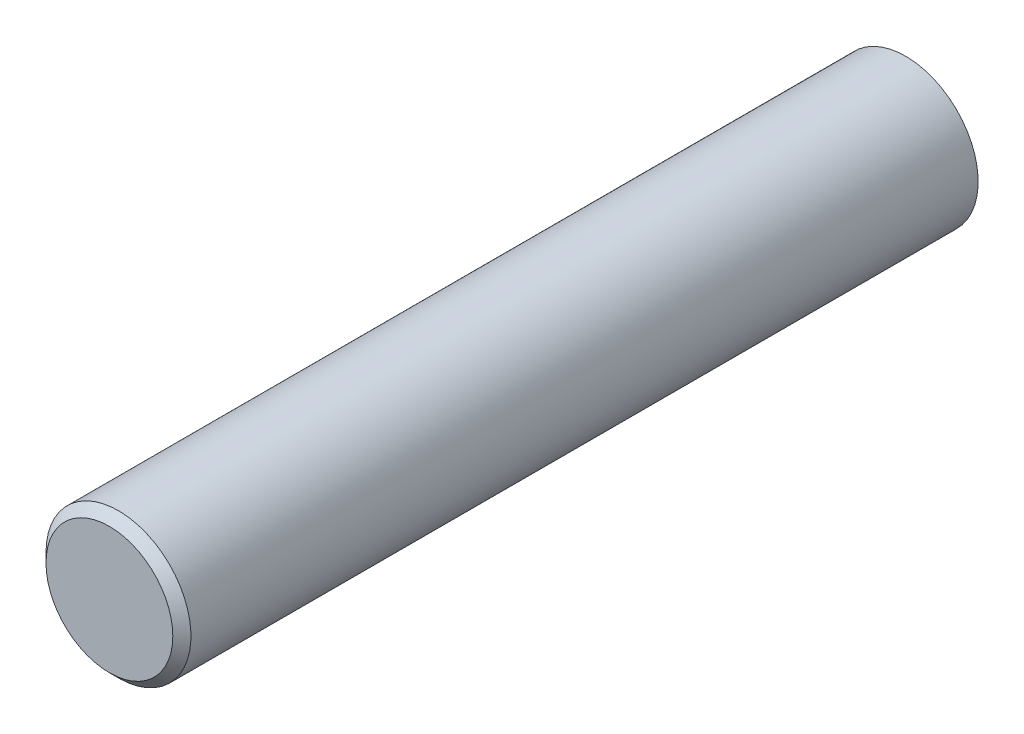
from build123d import *

# Parameters (mm, degrees)
ESQUISSE1_R        = 8
BOSS_EXTRU_1_DEPTH = 90
CHANFREIN1_SIZE    = 1


with BuildPart() as part:
    # Esquisse1 → Boss.-Extru.1 (new body)
    with BuildSketch(Plane.XY):
        with Locations(Location((0, 0, 0), (0, 0, 180))):
            Circle(ESQUISSE1_R)
    extrude(amount=BOSS_EXTRU_1_DEPTH)

    # Esquisse3 → Enl_vement de mati_re-R_volution1 (revolve, cut)
    with BuildSketch(Plane(origin=(0, 0, 0), x_dir=(0, 0, -1), z_dir=(1, 0, 0)), mode=Mode.PRIVATE) as enl_vement_de_mati_re_r_volution1_sk:
        with BuildLine():
            Line((0, 8), (-2.08633765, 8))
            ThreePointArc((-2.08633765, 8), (-0.530374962, 4.185425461), (0, 0.1))
            Line((0, 0.1), (0, 8))
        make_face()
    revolve(enl_vement_de_mati_re_r_volution1_sk.sketch.rotate(Axis((0, 0, 0), (0, 0, 1)), 90), axis=Axis((0, 0, 0), (0, 0, 1)), mode=Mode.SUBTRACT)

    # Chanfrein1
    chanfrein1_edges = [part.edges().sort_by_distance(p)[0] for p in [
        (8, 0, 90),
    ]]
    chamfer(chanfrein1_edges, length=CHANFREIN1_SIZE)


solid = part.part
